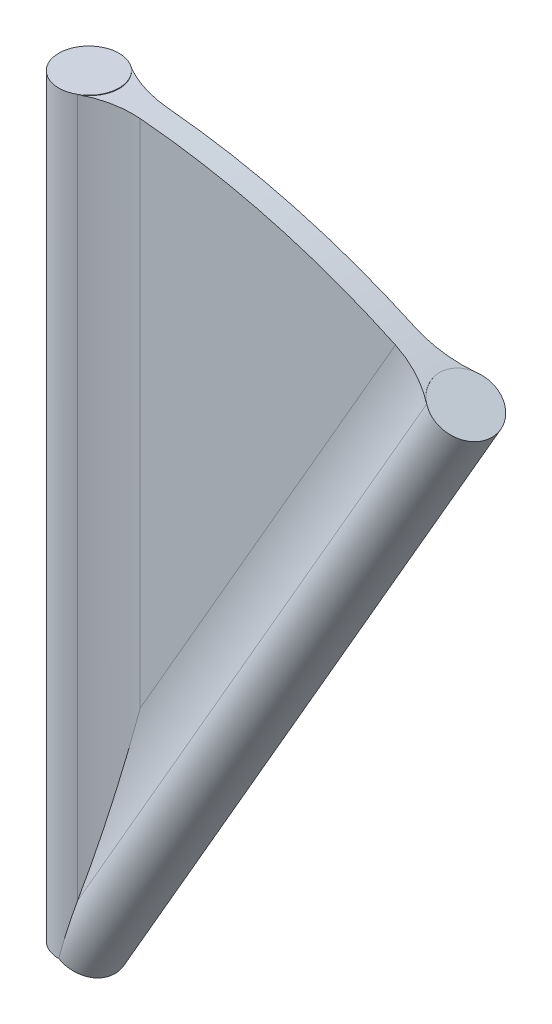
from build123d import *

# Parameters (mm, degrees)
SKETCH1_R      = 0.762
EXTRUDE1_DEPTH = 19.05
SKETCH2_R      = 0.762
EXTRUDE2_DEPTH = 19.05
SKETCH3_W      = 0.590053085
SKETCH3_H      = 16.670340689
REVOLVE1_ANGLE = 30
FILLET1_R      = 2.54


with BuildPart() as part:
    # Sketch1 → Extrude1 (new body)
    with BuildSketch(Plane(origin=(0, 0, 0), x_dir=(1, 0, 0), z_dir=(0, 1, 0))):
        with Locations(Location((0, 0, 0), (0, 0, 90))):
            Circle(SKETCH1_R)
    extrude(amount=EXTRUDE1_DEPTH)

    # Sketch2 → Extrude2 (add)
    with BuildSketch(Plane(origin=(0, 0, 0), x_dir=(-0.8660254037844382, 0.500000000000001, 0), z_dir=(0.500000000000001, 0.8660254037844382, 0))):
        with Locations(Location((0, 0, 0), (0, 0, 270))):
            Circle(SKETCH2_R)
    extrude(amount=EXTRUDE2_DEPTH)

    # Sketch3 → Revolve1 (revolve)
    with BuildSketch(Plane(origin=(0, 0, 0), x_dir=(0, 0, -1), z_dir=(1, 0, 0))):
        with Locations((-0.036878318, 10.714829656)):
            Rectangle(SKETCH3_W, SKETCH3_H)
    revolve(axis=Axis((0, 0, -0.8382), (0, 0, -1)), revolution_arc=REVOLVE1_ANGLE)

    # Fillet1
    fillet1_edges = [part.edges().sort_by_distance(p)[0] for p in [
        (0.685917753, 10.798763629, 0.33190486),
        (4.805359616, 9.694962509, 0.33190486),
        (4.807151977, 9.760112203, -0.258148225),
        (0.71694037, 10.8560811, -0.258148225),
    ]]
    fillet(fillet1_edges, radius=FILLET1_R)


solid = part.part
